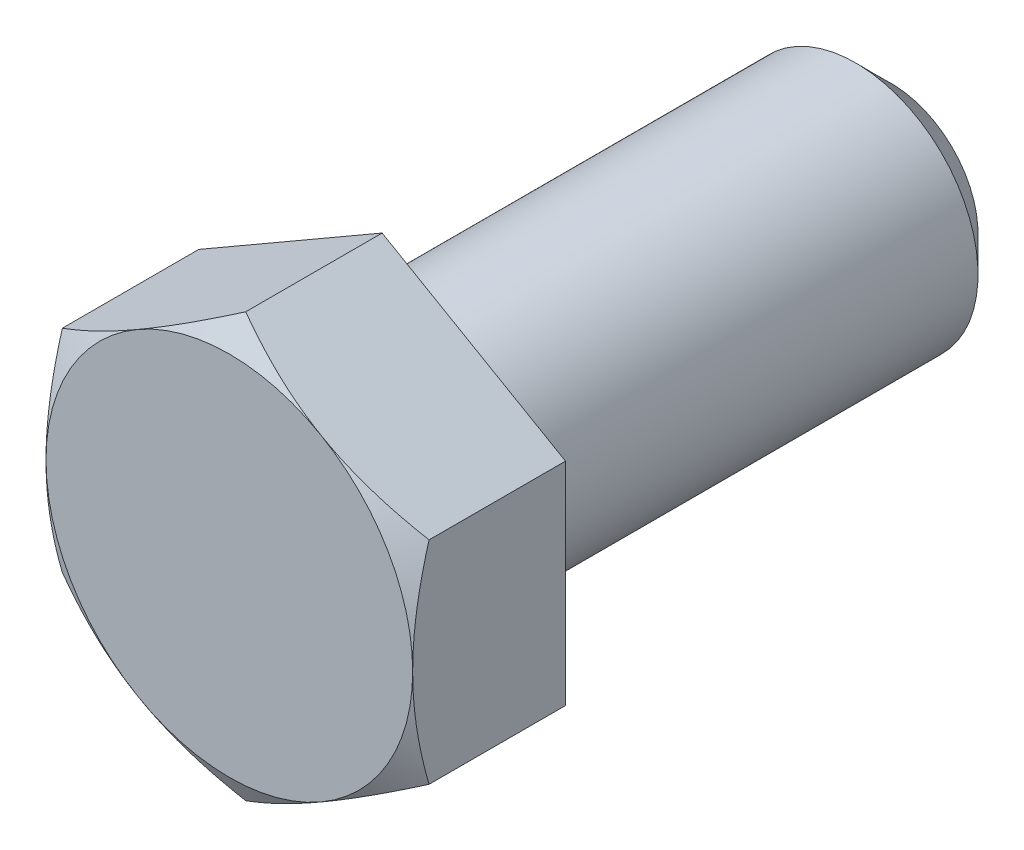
ISO-10303-21;
HEADER;
FILE_DESCRIPTION(('STEP AP214'),'2;1');
FILE_NAME('part.step','',(''),(''),'','','');
FILE_SCHEMA(('AUTOMOTIVE_DESIGN { 1 0 10303 214 1 1 1 1 }'));
ENDSEC;
DATA;
#1=APPLICATION_CONTEXT('core data for automotive mechanical design processes');
#2=APPLICATION_PROTOCOL_DEFINITION('international standard','automotive_design',2000,#1);
#3=PRODUCT_CONTEXT('',#1,'mechanical');
#4=PRODUCT('Part','Part','',(#3));
#5=PRODUCT_RELATED_PRODUCT_CATEGORY('part','',(#4));
#6=PRODUCT_DEFINITION_FORMATION('','',#4);
#7=PRODUCT_DEFINITION_CONTEXT('part definition',#1,'design');
#8=PRODUCT_DEFINITION('design','',#6,#7);
#9=PRODUCT_DEFINITION_SHAPE('','',#8);
#10=(LENGTH_UNIT() NAMED_UNIT(*) SI_UNIT(.MILLI.,.METRE.));
#11=(NAMED_UNIT(*) PLANE_ANGLE_UNIT() SI_UNIT($,.RADIAN.));
#12=(NAMED_UNIT(*) SI_UNIT($,.STERADIAN.) SOLID_ANGLE_UNIT());
#13=UNCERTAINTY_MEASURE_WITH_UNIT(LENGTH_MEASURE(1.E-05),#10,'distance_accuracy_value','');
#14=(GEOMETRIC_REPRESENTATION_CONTEXT(3) GLOBAL_UNCERTAINTY_ASSIGNED_CONTEXT((#13)) GLOBAL_UNIT_ASSIGNED_CONTEXT((#10,
#11,#12)) REPRESENTATION_CONTEXT('',''));
#15=CARTESIAN_POINT('',(0.,0.,0.));
#16=DIRECTION('',(0.,0.,1.));
#17=DIRECTION('',(1.,0.,0.));
#18=AXIS2_PLACEMENT_3D('',#15,#16,#17);
#19=CARTESIAN_POINT('',(-17.9999999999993,0.,0.));
#20=DIRECTION('',(0.,0.,1.));
#21=DIRECTION('',(1.,0.,0.));
#22=AXIS2_PLACEMENT_3D('',#19,#20,#21);
#23=PLANE('',#22);
#24=DIRECTION('',(-0.866025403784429,-0.500000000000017,0.));
#25=VECTOR('',#24,1.);
#26=CARTESIAN_POINT('',(-8.9999999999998,5.19615242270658,0.));
#27=LINE('',#26,#25);
#28=CARTESIAN_POINT('',(0.,10.3923048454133,0.));
#29=VERTEX_POINT('',#28);
#30=CARTESIAN_POINT('',(-8.9999999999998,5.19615242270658,0.));
#31=VERTEX_POINT('',#30);
#32=EDGE_CURVE('E136',#29,#31,#27,.T.);
#33=ORIENTED_EDGE('',*,*,#32,.F.);
#34=DIRECTION('',(-0.866025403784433,0.50000000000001,0.));
#35=VECTOR('',#34,1.);
#36=CARTESIAN_POINT('',(0.,10.3923048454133,0.));
#37=LINE('',#36,#35);
#38=CARTESIAN_POINT('',(9.,5.19615242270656,0.));
#39=VERTEX_POINT('',#38);
#40=EDGE_CURVE('E113',#39,#29,#37,.T.);
#41=ORIENTED_EDGE('',*,*,#40,.F.);
#42=DIRECTION('',(0.,1.,0.));
#43=VECTOR('',#42,1.);
#44=CARTESIAN_POINT('',(9.,5.19615242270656,0.));
#45=LINE('',#44,#43);
#46=CARTESIAN_POINT('',(9.,-5.19615242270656,0.));
#47=VERTEX_POINT('',#46);
#48=EDGE_CURVE('E106',#47,#39,#45,.T.);
#49=ORIENTED_EDGE('',*,*,#48,.F.);
#50=DIRECTION('',(0.866025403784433,0.50000000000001,0.));
#51=VECTOR('',#50,1.);
#52=CARTESIAN_POINT('',(9.,-5.19615242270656,0.));
#53=LINE('',#52,#51);
#54=CARTESIAN_POINT('',(0.,-10.3923048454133,0.));
#55=VERTEX_POINT('',#54);
#56=EDGE_CURVE('E441',#55,#47,#53,.T.);
#57=ORIENTED_EDGE('',*,*,#56,.F.);
#58=DIRECTION('',(0.866025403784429,-0.500000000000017,0.));
#59=VECTOR('',#58,1.);
#60=CARTESIAN_POINT('',(-8.9999999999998,-5.19615242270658,0.));
#61=LINE('',#60,#59);
#62=CARTESIAN_POINT('',(-8.9999999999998,-5.19615242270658,0.));
#63=VERTEX_POINT('',#62);
#64=EDGE_CURVE('E446',#63,#55,#61,.T.);
#65=ORIENTED_EDGE('',*,*,#64,.F.);
#66=DIRECTION('',(0.,-1.,0.));
#67=VECTOR('',#66,1.);
#68=CARTESIAN_POINT('',(-8.9999999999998,5.19615242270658,0.));
#69=LINE('',#68,#67);
#70=EDGE_CURVE('E157',#31,#63,#69,.T.);
#71=ORIENTED_EDGE('',*,*,#70,.F.);
#72=EDGE_LOOP('',(#33,#41,#49,#57,#65,#71));
#73=FACE_BOUND('',#72,.T.);
#74=CARTESIAN_POINT('',(0.,0.,0.));
#75=DIRECTION('',(0.,0.,-1.));
#76=DIRECTION('',(-1.,0.,0.));
#77=AXIS2_PLACEMENT_3D('',#74,#75,#76);
#78=CIRCLE('',#77,6.);
#79=CARTESIAN_POINT('',(-6.,0.,0.));
#80=VERTEX_POINT('',#79);
#81=EDGE_CURVE('E427',#80,#80,#78,.T.);
#82=ORIENTED_EDGE('',*,*,#81,.F.);
#83=EDGE_LOOP('',(#82));
#84=FACE_BOUND('',#83,.T.);
#85=ADVANCED_FACE('F16',(#73,#84),#23,.F.);
#86=CARTESIAN_POINT('',(-8.9999999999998,5.19615242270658,7.5));
#87=DIRECTION('',(0.500000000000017,-0.866025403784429,0.));
#88=DIRECTION('',(0.866025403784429,0.500000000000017,0.));
#89=AXIS2_PLACEMENT_3D('',#86,#87,#88);
#90=PLANE('',#89);
#91=CARTESIAN_POINT('',(0.000200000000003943,10.3924203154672,6.69608575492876));
#92=CARTESIAN_POINT('',(-0.197607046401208,10.2782163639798,6.76201799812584));
#93=CARTESIAN_POINT('',(-0.396185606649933,10.1635669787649,6.82495859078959));
#94=CARTESIAN_POINT('',(-0.794955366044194,9.93333715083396,6.94403100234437));
#95=CARTESIAN_POINT('',(-0.995147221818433,9.81775632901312,7.00015988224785));
#96=CARTESIAN_POINT('',(-1.39751505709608,9.58544915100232,7.10484803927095));
#97=CARTESIAN_POINT('',(-1.59969459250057,9.46872074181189,7.15338922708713));
#98=CARTESIAN_POINT('',(-2.00542875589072,9.23447001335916,7.241851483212));
#99=CARTESIAN_POINT('',(-2.20898309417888,9.11694786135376,7.28177431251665));
#100=CARTESIAN_POINT('',(-2.61230590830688,8.88408932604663,7.35131532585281));
#101=CARTESIAN_POINT('',(-2.81204459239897,8.76877014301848,7.38116249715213));
#102=CARTESIAN_POINT('',(-3.21241567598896,8.53761579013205,7.43120669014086));
#103=CARTESIAN_POINT('',(-3.41304799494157,8.42178066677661,7.4514045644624));
#104=CARTESIAN_POINT('',(-3.81466063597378,8.1899095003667,7.4816456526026));
#105=CARTESIAN_POINT('',(-4.0156403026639,8.07387383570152,7.49170039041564));
#106=CARTESIAN_POINT('',(-4.41778459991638,7.84169571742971,7.50143766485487));
#107=CARTESIAN_POINT('',(-4.61894922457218,7.72555326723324,7.50112052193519));
#108=CARTESIAN_POINT('',(-4.99503261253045,7.50842142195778,7.49083604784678));
#109=CARTESIAN_POINT('',(-5.16997789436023,7.4074167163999,7.48212325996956));
#110=CARTESIAN_POINT('',(-5.51945867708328,7.20564389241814,7.4570226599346));
#111=CARTESIAN_POINT('',(-5.69399414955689,7.10487579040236,7.4406343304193));
#112=CARTESIAN_POINT('',(-6.21692487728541,6.80296159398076,7.38034344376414));
#113=CARTESIAN_POINT('',(-6.56439451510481,6.6023499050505,7.32532251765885));
#114=CARTESIAN_POINT('',(-7.26301962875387,6.19899850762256,7.18776952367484));
#115=CARTESIAN_POINT('',(-7.61408594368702,5.99631027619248,7.10465438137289));
#116=CARTESIAN_POINT('',(-8.31098330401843,5.59395639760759,6.91601746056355));
#117=CARTESIAN_POINT('',(-8.65682327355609,5.39428559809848,6.81053998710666));
#118=CARTESIAN_POINT('',(-9.0001999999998,5.19603695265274,6.69608575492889));
#119=B_SPLINE_CURVE_WITH_KNOTS('',3,(#91,#92,#93,#94,#95,#96,#97,#98,#99,#100,#101,#102,#103,
#104,#105,#106,#107,#108,#109,#110,#111,#112,#113,#114,#115,#116,#117,#118),.UNSPECIFIED.,.F.,
.F.,(4,2,2,2,2,2,2,2,2,2,2,2,2,4),(0.,0.713219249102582,1.4267451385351,2.14194697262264,
2.85700253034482,3.55449749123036,4.25193080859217,4.94857085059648,5.64518936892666,
6.25162976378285,6.8581110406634,8.0719374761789,9.31268391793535,10.5509947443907),.UNSPECIFIED.);
#120=CARTESIAN_POINT('',(0.,10.3923048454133,6.69615242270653));
#121=VERTEX_POINT('',#120);
#122=CARTESIAN_POINT('',(-4.5,7.79422863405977,7.5));
#123=VERTEX_POINT('',#122);
#124=EDGE_CURVE('E133',#121,#123,#119,.T.);
#125=ORIENTED_EDGE('',*,*,#124,.F.);
#126=DIRECTION('',(0.,0.,-1.));
#127=VECTOR('',#126,1.);
#128=CARTESIAN_POINT('',(0.,10.3923048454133,7.5));
#129=LINE('',#128,#127);
#130=EDGE_CURVE('E109',#121,#29,#129,.T.);
#131=ORIENTED_EDGE('',*,*,#130,.T.);
#132=ORIENTED_EDGE('',*,*,#32,.T.);
#133=DIRECTION('',(0.,0.,-1.));
#134=VECTOR('',#133,1.);
#135=CARTESIAN_POINT('',(-8.9999999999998,5.19615242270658,7.5));
#136=LINE('',#135,#134);
#137=CARTESIAN_POINT('',(-8.9999999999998,5.19615242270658,6.69615242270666));
#138=VERTEX_POINT('',#137);
#139=EDGE_CURVE('E119',#138,#31,#136,.T.);
#140=ORIENTED_EDGE('',*,*,#139,.F.);
#141=EDGE_CURVE('E137',#123,#138,#119,.T.);
#142=ORIENTED_EDGE('',*,*,#141,.F.);
#143=EDGE_LOOP('',(#125,#131,#132,#140,#142));
#144=FACE_BOUND('',#143,.T.);
#145=ADVANCED_FACE('F139',(#144),#90,.F.);
#146=CARTESIAN_POINT('',(-8.9999999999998,5.19615242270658,7.5));
#147=DIRECTION('',(1.,0.,0.));
#148=DIRECTION('',(0.,0.,-1.));
#149=AXIS2_PLACEMENT_3D('',#146,#147,#148);
#150=PLANE('',#149);
#151=CARTESIAN_POINT('',(-8.9999999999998,-14.193805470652,2.99281770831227));
#152=CARTESIAN_POINT('',(-8.9999999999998,-13.7986249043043,3.18545400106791));
#153=CARTESIAN_POINT('',(-8.9999999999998,-13.4025620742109,3.37631016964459));
#154=CARTESIAN_POINT('',(-8.9999999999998,-12.6082034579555,3.75346543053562));
#155=CARTESIAN_POINT('',(-8.9999999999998,-12.2099073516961,3.93976384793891));
#156=CARTESIAN_POINT('',(-8.9999999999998,-11.4086732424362,4.30769386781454));
#157=CARTESIAN_POINT('',(-8.9999999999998,-11.0057218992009,4.4892965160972));
#158=CARTESIAN_POINT('',(-8.9999999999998,-10.1966954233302,4.84537774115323));
#159=CARTESIAN_POINT('',(-8.9999999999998,-9.7906204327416,5.01985663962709));
#160=CARTESIAN_POINT('',(-8.9999999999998,-8.96081603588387,5.36560228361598));
#161=CARTESIAN_POINT('',(-8.9999999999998,-8.53695616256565,5.53655757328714));
#162=CARTESIAN_POINT('',(-8.9999999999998,-7.68436682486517,5.86609252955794));
#163=CARTESIAN_POINT('',(-8.9999999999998,-7.25563683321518,6.02467084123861));
#164=CARTESIAN_POINT('',(-8.9999999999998,-6.39334839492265,6.32546141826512));
#165=CARTESIAN_POINT('',(-8.9999999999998,-5.95980093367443,6.46770484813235));
#166=CARTESIAN_POINT('',(-8.9999999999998,-5.08650675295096,6.7314200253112));
#167=CARTESIAN_POINT('',(-8.9999999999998,-4.6467619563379,6.85289806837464));
#168=CARTESIAN_POINT('',(-8.9999999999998,-3.76318857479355,7.06875933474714));
#169=CARTESIAN_POINT('',(-8.9999999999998,-3.31939822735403,7.16329494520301));
#170=CARTESIAN_POINT('',(-8.9999999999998,-2.64948950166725,7.28091249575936));
#171=CARTESIAN_POINT('',(-8.9999999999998,-2.42546830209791,7.31608884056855));
#172=CARTESIAN_POINT('',(-8.9999999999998,-1.97623392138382,7.37769613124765));
#173=CARTESIAN_POINT('',(-8.9999999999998,-1.75102085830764,7.40412792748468));
#174=CARTESIAN_POINT('',(-8.9999999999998,-1.3027498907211,7.44737513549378));
#175=CARTESIAN_POINT('',(-8.9999999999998,-1.07970414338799,7.46431601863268));
#176=CARTESIAN_POINT('',(-8.9999999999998,-0.633095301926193,7.48874105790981));
#177=CARTESIAN_POINT('',(-8.9999999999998,-0.409532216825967,7.49622537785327));
#178=CARTESIAN_POINT('',(-8.9999999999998,0.0377121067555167,7.5015576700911));
#179=CARTESIAN_POINT('',(-8.9999999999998,0.261393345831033,7.49940559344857));
#180=CARTESIAN_POINT('',(-8.9999999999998,0.708460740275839,7.48552018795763));
#181=CARTESIAN_POINT('',(-8.9999999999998,0.931846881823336,7.47378642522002));
#182=CARTESIAN_POINT('',(-8.9999999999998,1.46162752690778,7.4348503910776));
#183=CARTESIAN_POINT('',(-8.9999999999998,1.7677239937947,7.40349650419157));
#184=CARTESIAN_POINT('',(-8.9999999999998,2.37778404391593,7.32445593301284));
#185=CARTESIAN_POINT('',(-8.9999999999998,2.68174735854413,7.2767672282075));
#186=CARTESIAN_POINT('',(-8.9999999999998,3.59000335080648,7.11171638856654));
#187=CARTESIAN_POINT('',(-8.9999999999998,4.19036603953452,6.97239428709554));
#188=CARTESIAN_POINT('',(-8.9999999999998,5.088581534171,6.72898039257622));
#189=CARTESIAN_POINT('',(-8.9999999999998,5.3910401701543,6.64089135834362));
#190=CARTESIAN_POINT('',(-8.9999999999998,5.9930241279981,6.45511431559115));
#191=CARTESIAN_POINT('',(-8.9999999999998,6.29254942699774,6.35742623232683));
#192=CARTESIAN_POINT('',(-8.9999999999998,6.88875586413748,6.15405553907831));
#193=CARTESIAN_POINT('',(-8.9999999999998,7.18543776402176,6.04837514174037));
#194=CARTESIAN_POINT('',(-8.9999999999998,7.77631041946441,5.83030807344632));
#195=CARTESIAN_POINT('',(-8.9999999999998,8.07050123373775,5.7179215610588));
#196=CARTESIAN_POINT('',(-8.9999999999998,8.86768097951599,5.40462740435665));
#197=CARTESIAN_POINT('',(-8.9999999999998,9.36851420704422,5.19823951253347));
#198=CARTESIAN_POINT('',(-8.9999999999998,10.3649647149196,4.77318997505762));
#199=CARTESIAN_POINT('',(-8.9999999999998,10.8605813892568,4.55452692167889));
#200=CARTESIAN_POINT('',(-8.9999999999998,11.8478077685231,4.10785524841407));
#201=CARTESIAN_POINT('',(-8.9999999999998,12.3394158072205,3.87984295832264));
#202=CARTESIAN_POINT('',(-8.9999999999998,13.3192435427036,3.41672758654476));
#203=CARTESIAN_POINT('',(-8.9999999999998,13.8074633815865,3.18162480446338));
#204=CARTESIAN_POINT('',(-8.9999999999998,14.7819931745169,2.70549247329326));
#205=CARTESIAN_POINT('',(-8.9999999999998,15.2682986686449,2.46445381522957));
#206=CARTESIAN_POINT('',(-8.9999999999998,16.238706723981,1.97797920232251));
#207=CARTESIAN_POINT('',(-8.9999999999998,16.7228092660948,1.7325432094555));
#208=CARTESIAN_POINT('',(-8.9999999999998,17.6890969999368,1.2381998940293));
#209=CARTESIAN_POINT('',(-8.9999999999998,18.1712826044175,0.989293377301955));
#210=CARTESIAN_POINT('',(-8.9999999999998,19.1341609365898,0.488607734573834));
#211=CARTESIAN_POINT('',(-8.9999999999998,19.6148536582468,0.236828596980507));
#212=CARTESIAN_POINT('',(-8.9999999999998,20.9522159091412,-0.467839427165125));
#213=CARTESIAN_POINT('',(-8.9999999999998,21.8075292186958,-0.923301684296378));
#214=CARTESIAN_POINT('',(-8.9999999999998,23.5152984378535,-1.83966951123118));
#215=CARTESIAN_POINT('',(-8.9999999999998,24.367754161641,-2.30057542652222));
#216=CARTESIAN_POINT('',(-8.9999999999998,26.0675482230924,-3.22485857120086));
#217=CARTESIAN_POINT('',(-8.9999999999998,26.9148940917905,-3.68822195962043));
#218=CARTESIAN_POINT('',(-8.9999999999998,28.1846057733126,-4.38556367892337));
#219=CARTESIAN_POINT('',(-8.9999999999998,28.6076082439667,-4.61838432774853));
#220=CARTESIAN_POINT('',(-8.9999999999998,29.4532343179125,-5.08471147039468));
#221=CARTESIAN_POINT('',(-8.9999999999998,29.8758579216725,-5.3182179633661));
#222=CARTESIAN_POINT('',(-8.9999999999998,30.2983153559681,-5.55202477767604));
#223=B_SPLINE_CURVE_WITH_KNOTS('',3,(#151,#152,#153,#154,#155,#156,#157,#158,#159,#160,#161,
#162,#163,#164,#165,#166,#167,#168,#169,#170,#171,#172,#173,#174,#175,#176,#177,#178,#179,#180,
#181,#182,#183,#184,#185,#186,#187,#188,#189,#190,#191,#192,#193,#194,#195,#196,#197,#198,#199,
#200,#201,#202,#203,#204,#205,#206,#207,#208,#209,#210,#211,#212,#213,#214,#215,#216,#217,#218,
#219,#220,#221,#222),.UNSPECIFIED.,.F.,.F.,(4,2,2,2,2,2,2,2,2,2,2,2,2,2,2,2,2,2,2,2,2,2,2,2,2,2,
2,2,2,2,2,2,2,2,2,4),(0.,1.31891143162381,2.63801699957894,3.96391175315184,5.28974656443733,
6.66070766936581,8.03181864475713,9.40026868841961,10.7683030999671,12.1284389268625,
12.8085936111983,13.4886821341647,14.1595537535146,14.8304137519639,15.5012771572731,
16.1721709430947,17.0947490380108,18.0174412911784,19.8637129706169,20.8087031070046,
21.7537006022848,22.6984374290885,23.6431519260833,25.2679809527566,26.8929966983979,
28.5186565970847,30.1442479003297,31.7725119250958,33.4007900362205,35.0286961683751,
36.6566088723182,39.5636489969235,42.4708746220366,45.3681585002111,46.8166845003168,
48.2652087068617),.UNSPECIFIED.);
#224=CARTESIAN_POINT('',(-8.99999999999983,0.,7.5));
#225=VERTEX_POINT('',#224);
#226=EDGE_CURVE('E143',#138,#225,#223,.F.);
#227=ORIENTED_EDGE('',*,*,#226,.F.);
#228=ORIENTED_EDGE('',*,*,#139,.T.);
#229=ORIENTED_EDGE('',*,*,#70,.T.);
#230=DIRECTION('',(0.,0.,-1.));
#231=VECTOR('',#230,1.);
#232=CARTESIAN_POINT('',(-8.9999999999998,-5.19615242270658,7.5));
#233=LINE('',#232,#231);
#234=CARTESIAN_POINT('',(-8.9999999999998,-5.19615242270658,6.69615242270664));
#235=VERTEX_POINT('',#234);
#236=EDGE_CURVE('E118',#235,#63,#233,.T.);
#237=ORIENTED_EDGE('',*,*,#236,.F.);
#238=EDGE_CURVE('E144',#225,#235,#223,.F.);
#239=ORIENTED_EDGE('',*,*,#238,.F.);
#240=EDGE_LOOP('',(#227,#228,#229,#237,#239));
#241=FACE_BOUND('',#240,.T.);
#242=ADVANCED_FACE('F206',(#241),#150,.F.);
#243=CARTESIAN_POINT('',(-8.9999999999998,-5.19615242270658,7.5));
#244=DIRECTION('',(0.500000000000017,0.866025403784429,0.));
#245=DIRECTION('',(-0.866025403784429,0.500000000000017,0.));
#246=AXIS2_PLACEMENT_3D('',#243,#244,#245);
#247=PLANE('',#246);
#248=CARTESIAN_POINT('',(-9.0001999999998,-5.19603695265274,6.69608575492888));
#249=CARTESIAN_POINT('',(-8.80239295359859,-5.31024090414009,6.76201799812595));
#250=CARTESIAN_POINT('',(-8.60381439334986,-5.42489028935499,6.82495859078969));
#251=CARTESIAN_POINT('',(-8.20504463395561,-5.65512011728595,6.94403100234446));
#252=CARTESIAN_POINT('',(-8.00485277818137,-5.77070093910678,7.00015988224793));
#253=CARTESIAN_POINT('',(-7.60248494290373,-6.00300811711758,7.10484803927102));
#254=CARTESIAN_POINT('',(-7.40030540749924,-6.11973652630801,7.1533892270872));
#255=CARTESIAN_POINT('',(-6.9945712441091,-6.35398725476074,7.24185148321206));
#256=CARTESIAN_POINT('',(-6.79101690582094,-6.47150940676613,7.2817743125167));
#257=CARTESIAN_POINT('',(-6.38769409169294,-6.70436794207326,7.35131532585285));
#258=CARTESIAN_POINT('',(-6.18795540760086,-6.81968712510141,7.38116249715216));
#259=CARTESIAN_POINT('',(-5.78758432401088,-7.05084147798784,7.43120669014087));
#260=CARTESIAN_POINT('',(-5.58695200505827,-7.16667660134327,7.45140456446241));
#261=CARTESIAN_POINT('',(-5.18533936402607,-7.39854776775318,7.48164565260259));
#262=CARTESIAN_POINT('',(-4.98435969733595,-7.51458343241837,7.49170039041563));
#263=CARTESIAN_POINT('',(-4.58221540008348,-7.74676155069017,7.50143766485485));
#264=CARTESIAN_POINT('',(-4.38105077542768,-7.86290400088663,7.50112052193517));
#265=CARTESIAN_POINT('',(-4.00496738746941,-8.08003584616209,7.49083604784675));
#266=CARTESIAN_POINT('',(-3.83002210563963,-8.18104055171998,7.48212325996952));
#267=CARTESIAN_POINT('',(-3.48054132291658,-8.38281337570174,7.45702265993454));
#268=CARTESIAN_POINT('',(-3.30600585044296,-8.48358147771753,7.44063433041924));
#269=CARTESIAN_POINT('',(-2.78307512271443,-8.78549567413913,7.38034344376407));
#270=CARTESIAN_POINT('',(-2.43560548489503,-8.9861073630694,7.32532251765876));
#271=CARTESIAN_POINT('',(-1.73698037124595,-9.38945876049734,7.18776952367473));
#272=CARTESIAN_POINT('',(-1.38591405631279,-9.59214699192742,7.10465438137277));
#273=CARTESIAN_POINT('',(-0.689016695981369,-9.99450087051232,6.91601746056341));
#274=CARTESIAN_POINT('',(-0.343176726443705,-10.1941716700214,6.81053998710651));
#275=CARTESIAN_POINT('',(0.00020000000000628,-10.3924203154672,6.69608575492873));
#276=B_SPLINE_CURVE_WITH_KNOTS('',3,(#248,#249,#250,#251,#252,#253,#254,#255,#256,#257,#258,
#259,#260,#261,#262,#263,#264,#265,#266,#267,#268,#269,#270,#271,#272,#273,#274,#275),
.UNSPECIFIED.,.F.,.F.,(4,2,2,2,2,2,2,2,2,2,2,2,2,4),(0.,0.713219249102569,1.42674513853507,
2.1419469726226,2.85700253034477,3.55449749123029,4.25193080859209,4.94857085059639,
5.64518936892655,6.25162976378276,6.85811104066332,8.07193747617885,9.31268391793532,
10.5509947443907),.UNSPECIFIED.);
#277=CARTESIAN_POINT('',(-4.5,-7.79422863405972,7.5));
#278=VERTEX_POINT('',#277);
#279=EDGE_CURVE('E191',#235,#278,#276,.T.);
#280=ORIENTED_EDGE('',*,*,#279,.F.);
#281=ORIENTED_EDGE('',*,*,#236,.T.);
#282=ORIENTED_EDGE('',*,*,#64,.T.);
#283=DIRECTION('',(0.,0.,-1.));
#284=VECTOR('',#283,1.);
#285=CARTESIAN_POINT('',(0.,-10.3923048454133,7.5));
#286=LINE('',#285,#284);
#287=CARTESIAN_POINT('',(0.,-10.3923048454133,6.6961524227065));
#288=VERTEX_POINT('',#287);
#289=EDGE_CURVE('E111',#288,#55,#286,.T.);
#290=ORIENTED_EDGE('',*,*,#289,.F.);
#291=EDGE_CURVE('E186',#278,#288,#276,.T.);
#292=ORIENTED_EDGE('',*,*,#291,.F.);
#293=EDGE_LOOP('',(#280,#281,#282,#290,#292));
#294=FACE_BOUND('',#293,.T.);
#295=ADVANCED_FACE('F209',(#294),#247,.F.);
#296=CARTESIAN_POINT('',(9.,-5.19615242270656,7.5));
#297=DIRECTION('',(-0.50000000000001,0.866025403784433,0.));
#298=DIRECTION('',(-0.866025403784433,-0.50000000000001,0.));
#299=AXIS2_PLACEMENT_3D('',#296,#297,#298);
#300=PLANE('',#299);
#301=CARTESIAN_POINT('',(-0.000199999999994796,-10.3924203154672,6.69608575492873));
#302=CARTESIAN_POINT('',(0.197607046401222,-10.2782163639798,6.76201799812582));
#303=CARTESIAN_POINT('',(0.39618560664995,-10.1635669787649,6.82495859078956));
#304=CARTESIAN_POINT('',(0.794955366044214,-9.93333715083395,6.94403100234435));
#305=CARTESIAN_POINT('',(0.995147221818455,-9.81775632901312,7.00015988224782));
#306=CARTESIAN_POINT('',(1.3975150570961,-9.58544915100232,7.10484803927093));
#307=CARTESIAN_POINT('',(1.5996945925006,-9.46872074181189,7.15338922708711));
#308=CARTESIAN_POINT('',(2.00542875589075,-9.23447001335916,7.24185148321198));
#309=CARTESIAN_POINT('',(2.20898309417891,-9.11694786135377,7.28177431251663));
#310=CARTESIAN_POINT('',(2.61230590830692,-8.88408932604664,7.35131532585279));
#311=CARTESIAN_POINT('',(2.81204459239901,-8.76877014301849,7.38116249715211));
#312=CARTESIAN_POINT('',(3.212415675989,-8.53761579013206,7.43120669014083));
#313=CARTESIAN_POINT('',(3.41304799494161,-8.42178066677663,7.45140456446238));
#314=CARTESIAN_POINT('',(3.81466063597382,-8.18990950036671,7.48164565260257));
#315=CARTESIAN_POINT('',(4.01564030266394,-8.07387383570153,7.49170039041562));
#316=CARTESIAN_POINT('',(4.41778459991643,-7.84169571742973,7.50143766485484));
#317=CARTESIAN_POINT('',(4.61894922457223,-7.72555326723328,7.50112052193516));
#318=CARTESIAN_POINT('',(4.99503261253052,-7.50842142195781,7.49083604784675));
#319=CARTESIAN_POINT('',(5.1699778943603,-7.40741671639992,7.48212325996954));
#320=CARTESIAN_POINT('',(5.51945867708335,-7.20564389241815,7.45702265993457));
#321=CARTESIAN_POINT('',(5.69399414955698,-7.10487579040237,7.44063433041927));
#322=CARTESIAN_POINT('',(6.21692487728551,-6.80296159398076,7.38034344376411));
#323=CARTESIAN_POINT('',(6.56439451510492,-6.6023499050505,7.32532251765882));
#324=CARTESIAN_POINT('',(7.263019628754,-6.19899850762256,7.1877695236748));
#325=CARTESIAN_POINT('',(7.61408594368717,-5.99631027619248,7.10465438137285));
#326=CARTESIAN_POINT('',(8.31098330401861,-5.59395639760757,6.91601746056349));
#327=CARTESIAN_POINT('',(8.65682327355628,-5.39428559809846,6.8105399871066));
#328=CARTESIAN_POINT('',(9.0002,-5.19603695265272,6.69608575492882));
#329=B_SPLINE_CURVE_WITH_KNOTS('',3,(#301,#302,#303,#304,#305,#306,#307,#308,#309,#310,#311,
#312,#313,#314,#315,#316,#317,#318,#319,#320,#321,#322,#323,#324,#325,#326,#327,#328),
.UNSPECIFIED.,.F.,.F.,(4,2,2,2,2,2,2,2,2,2,2,2,2,4),(0.,0.713219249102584,1.4267451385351,
2.14194697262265,2.85700253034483,3.55449749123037,4.25193080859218,4.9485708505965,
5.64518936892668,6.25162976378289,6.85811104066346,8.071937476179,9.31268391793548,
10.5509947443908),.UNSPECIFIED.);
#330=CARTESIAN_POINT('',(4.50000000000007,-7.79422863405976,7.5));
#331=VERTEX_POINT('',#330);
#332=EDGE_CURVE('E192',#288,#331,#329,.T.);
#333=ORIENTED_EDGE('',*,*,#332,.F.);
#334=ORIENTED_EDGE('',*,*,#289,.T.);
#335=ORIENTED_EDGE('',*,*,#56,.T.);
#336=DIRECTION('',(0.,0.,-1.));
#337=VECTOR('',#336,1.);
#338=CARTESIAN_POINT('',(9.,-5.19615242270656,7.5));
#339=LINE('',#338,#337);
#340=CARTESIAN_POINT('',(9.,-5.19615242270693,6.69615242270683));
#341=VERTEX_POINT('',#340);
#342=EDGE_CURVE('E108',#341,#47,#339,.T.);
#343=ORIENTED_EDGE('',*,*,#342,.F.);
#344=EDGE_CURVE('E181',#331,#341,#329,.T.);
#345=ORIENTED_EDGE('',*,*,#344,.F.);
#346=EDGE_LOOP('',(#333,#334,#335,#343,#345));
#347=FACE_BOUND('',#346,.T.);
#348=ADVANCED_FACE('F212',(#347),#300,.F.);
#349=CARTESIAN_POINT('',(9.,5.19615242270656,7.5));
#350=DIRECTION('',(-1.,0.,0.));
#351=DIRECTION('',(0.,0.,1.));
#352=AXIS2_PLACEMENT_3D('',#349,#350,#351);
#353=PLANE('',#352);
#354=CARTESIAN_POINT('',(9.,-14.193805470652,2.99281770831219));
#355=CARTESIAN_POINT('',(9.,-13.7986249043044,3.18545400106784));
#356=CARTESIAN_POINT('',(9.,-13.402562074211,3.37631016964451));
#357=CARTESIAN_POINT('',(9.,-12.6082034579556,3.75346543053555));
#358=CARTESIAN_POINT('',(9.,-12.2099073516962,3.93976384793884));
#359=CARTESIAN_POINT('',(9.,-11.4086732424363,4.30769386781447));
#360=CARTESIAN_POINT('',(9.,-11.0057218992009,4.48929651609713));
#361=CARTESIAN_POINT('',(9.,-10.1966954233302,4.84537774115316));
#362=CARTESIAN_POINT('',(9.,-9.79062043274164,5.01985663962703));
#363=CARTESIAN_POINT('',(9.,-8.96081603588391,5.36560228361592));
#364=CARTESIAN_POINT('',(9.,-8.53695616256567,5.53655757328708));
#365=CARTESIAN_POINT('',(9.,-7.68436682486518,5.86609252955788));
#366=CARTESIAN_POINT('',(9.,-7.25563683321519,6.02467084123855));
#367=CARTESIAN_POINT('',(9.,-6.39334839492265,6.32546141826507));
#368=CARTESIAN_POINT('',(9.,-5.95980093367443,6.4677048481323));
#369=CARTESIAN_POINT('',(9.,-5.08650675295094,6.73142002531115));
#370=CARTESIAN_POINT('',(9.,-4.64676195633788,6.85289806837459));
#371=CARTESIAN_POINT('',(9.,-3.76318857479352,7.06875933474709));
#372=CARTESIAN_POINT('',(9.,-3.31939822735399,7.16329494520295));
#373=CARTESIAN_POINT('',(9.,-2.64948950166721,7.2809124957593));
#374=CARTESIAN_POINT('',(9.,-2.42546830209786,7.31608884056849));
#375=CARTESIAN_POINT('',(9.,-1.97623392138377,7.37769613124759));
#376=CARTESIAN_POINT('',(9.,-1.75102085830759,7.40412792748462));
#377=CARTESIAN_POINT('',(9.,-1.30274989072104,7.44737513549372));
#378=CARTESIAN_POINT('',(9.,-1.07970414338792,7.46431601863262));
#379=CARTESIAN_POINT('',(9.,-0.633095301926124,7.48874105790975));
#380=CARTESIAN_POINT('',(9.,-0.409532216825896,7.4962253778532));
#381=CARTESIAN_POINT('',(9.,0.0377121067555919,7.50155767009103));
#382=CARTESIAN_POINT('',(9.,0.26139334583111,7.4994055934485));
#383=CARTESIAN_POINT('',(9.,0.708460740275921,7.48552018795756));
#384=CARTESIAN_POINT('',(9.,0.93184688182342,7.47378642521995));
#385=CARTESIAN_POINT('',(9.,1.46162752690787,7.43485039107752));
#386=CARTESIAN_POINT('',(9.,1.7677239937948,7.40349650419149));
#387=CARTESIAN_POINT('',(9.,2.37778404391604,7.32445593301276));
#388=CARTESIAN_POINT('',(9.,2.68174735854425,7.27676722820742));
#389=CARTESIAN_POINT('',(9.,3.59000335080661,7.11171638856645));
#390=CARTESIAN_POINT('',(9.,4.19036603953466,6.97239428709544));
#391=CARTESIAN_POINT('',(9.,5.08858153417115,6.72898039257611));
#392=CARTESIAN_POINT('',(9.,5.39104017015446,6.64089135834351));
#393=CARTESIAN_POINT('',(9.,5.99302412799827,6.45511431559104));
#394=CARTESIAN_POINT('',(9.,6.29254942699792,6.35742623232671));
#395=CARTESIAN_POINT('',(9.,6.88875586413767,6.15405553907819));
#396=CARTESIAN_POINT('',(9.,7.18543776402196,6.04837514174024));
#397=CARTESIAN_POINT('',(9.,7.77631041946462,5.83030807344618));
#398=CARTESIAN_POINT('',(9.,8.07050123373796,5.71792156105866));
#399=CARTESIAN_POINT('',(9.,8.86768097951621,5.40462740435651));
#400=CARTESIAN_POINT('',(9.,9.36851420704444,5.19823951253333));
#401=CARTESIAN_POINT('',(9.,10.3649647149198,4.77318997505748));
#402=CARTESIAN_POINT('',(9.,10.860581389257,4.55452692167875));
#403=CARTESIAN_POINT('',(9.,11.8478077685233,4.10785524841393));
#404=CARTESIAN_POINT('',(9.,12.3394158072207,3.8798429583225));
#405=CARTESIAN_POINT('',(9.,13.3192435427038,3.41672758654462));
#406=CARTESIAN_POINT('',(9.,13.8074633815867,3.18162480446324));
#407=CARTESIAN_POINT('',(9.,14.7819931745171,2.70549247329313));
#408=CARTESIAN_POINT('',(9.,15.2682986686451,2.46445381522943));
#409=CARTESIAN_POINT('',(9.,16.2387067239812,1.97797920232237));
#410=CARTESIAN_POINT('',(9.,16.722809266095,1.73254320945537));
#411=CARTESIAN_POINT('',(9.,17.689096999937,1.23819989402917));
#412=CARTESIAN_POINT('',(9.,18.1712826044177,0.989293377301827));
#413=CARTESIAN_POINT('',(9.,19.13416093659,0.488607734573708));
#414=CARTESIAN_POINT('',(9.,19.614853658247,0.236828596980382));
#415=CARTESIAN_POINT('',(9.,20.9522159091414,-0.467839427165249));
#416=CARTESIAN_POINT('',(9.,21.807529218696,-0.923301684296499));
#417=CARTESIAN_POINT('',(9.,23.5152984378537,-1.8396695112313));
#418=CARTESIAN_POINT('',(9.,24.3677541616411,-2.30057542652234));
#419=CARTESIAN_POINT('',(9.,26.0675482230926,-3.22485857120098));
#420=CARTESIAN_POINT('',(9.,26.9148940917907,-3.68822195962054));
#421=CARTESIAN_POINT('',(9.,28.1846057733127,-4.38556367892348));
#422=CARTESIAN_POINT('',(9.,28.6076082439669,-4.61838432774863));
#423=CARTESIAN_POINT('',(9.,29.4532343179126,-5.08471147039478));
#424=CARTESIAN_POINT('',(9.,29.8758579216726,-5.31821796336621));
#425=CARTESIAN_POINT('',(9.,30.2983153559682,-5.55202477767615));
#426=B_SPLINE_CURVE_WITH_KNOTS('',3,(#354,#355,#356,#357,#358,#359,#360,#361,#362,#363,#364,
#365,#366,#367,#368,#369,#370,#371,#372,#373,#374,#375,#376,#377,#378,#379,#380,#381,#382,#383,
#384,#385,#386,#387,#388,#389,#390,#391,#392,#393,#394,#395,#396,#397,#398,#399,#400,#401,#402,
#403,#404,#405,#406,#407,#408,#409,#410,#411,#412,#413,#414,#415,#416,#417,#418,#419,#420,#421,
#422,#423,#424,#425),.UNSPECIFIED.,.F.,.F.,(4,2,2,2,2,2,2,2,2,2,2,2,2,2,2,2,2,2,2,2,2,2,2,2,2,2,
2,2,2,2,2,2,2,2,2,4),(0.,1.31891143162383,2.63801699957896,3.96391175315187,5.28974656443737,
6.66070766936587,8.03181864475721,9.4002686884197,10.7683030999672,12.1284389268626,
12.8085936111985,13.4886821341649,14.1595537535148,14.8304137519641,15.5012771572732,
16.1721709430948,17.0947490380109,18.0174412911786,19.8637129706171,20.8087031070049,
21.7537006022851,22.6984374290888,23.6431519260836,25.2679809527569,26.8929966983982,
28.5186565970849,30.14424790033,31.7725119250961,33.4007900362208,35.0286961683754,
36.6566088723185,39.5636489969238,42.4708746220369,45.3681585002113,46.8166845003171,
48.265208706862),.UNSPECIFIED.);
#427=CARTESIAN_POINT('',(9.,0.,7.5));
#428=VERTEX_POINT('',#427);
#429=EDGE_CURVE('E96',#341,#428,#426,.T.);
#430=ORIENTED_EDGE('',*,*,#429,.F.);
#431=ORIENTED_EDGE('',*,*,#342,.T.);
#432=ORIENTED_EDGE('',*,*,#48,.T.);
#433=DIRECTION('',(0.,0.,-1.));
#434=VECTOR('',#433,1.);
#435=CARTESIAN_POINT('',(9.,5.19615242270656,7.5));
#436=LINE('',#435,#434);
#437=CARTESIAN_POINT('',(9.,5.1961524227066,6.69615242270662));
#438=VERTEX_POINT('',#437);
#439=EDGE_CURVE('E100',#438,#39,#436,.T.);
#440=ORIENTED_EDGE('',*,*,#439,.F.);
#441=EDGE_CURVE('E88',#428,#438,#426,.T.);
#442=ORIENTED_EDGE('',*,*,#441,.F.);
#443=EDGE_LOOP('',(#430,#431,#432,#440,#442));
#444=FACE_BOUND('',#443,.T.);
#445=ADVANCED_FACE('F104',(#444),#353,.F.);
#446=CARTESIAN_POINT('',(0.,10.3923048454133,7.5));
#447=DIRECTION('',(-0.50000000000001,-0.866025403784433,0.));
#448=DIRECTION('',(0.866025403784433,-0.50000000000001,0.));
#449=AXIS2_PLACEMENT_3D('',#446,#447,#448);
#450=PLANE('',#449);
#451=CARTESIAN_POINT('',(9.0002,5.19603695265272,6.69608575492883));
#452=CARTESIAN_POINT('',(8.80239295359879,5.31024090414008,6.76201799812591));
#453=CARTESIAN_POINT('',(8.60381439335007,5.42489028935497,6.82495859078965));
#454=CARTESIAN_POINT('',(8.20504463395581,5.65512011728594,6.94403100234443));
#455=CARTESIAN_POINT('',(8.00485277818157,5.77070093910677,7.0001598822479));
#456=CARTESIAN_POINT('',(7.60248494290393,6.00300811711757,7.104848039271));
#457=CARTESIAN_POINT('',(7.40030540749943,6.11973652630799,7.15338922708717));
#458=CARTESIAN_POINT('',(6.99457124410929,6.35398725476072,7.24185148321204));
#459=CARTESIAN_POINT('',(6.79101690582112,6.47150940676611,7.28177431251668));
#460=CARTESIAN_POINT('',(6.38769409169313,6.70436794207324,7.35131532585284));
#461=CARTESIAN_POINT('',(6.18795540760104,6.81968712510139,7.38116249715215));
#462=CARTESIAN_POINT('',(5.78758432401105,7.05084147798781,7.43120669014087));
#463=CARTESIAN_POINT('',(5.58695200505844,7.16667660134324,7.45140456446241));
#464=CARTESIAN_POINT('',(5.18533936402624,7.39854776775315,7.4816456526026));
#465=CARTESIAN_POINT('',(4.98435969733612,7.51458343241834,7.49170039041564));
#466=CARTESIAN_POINT('',(4.58221540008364,7.74676155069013,7.50143766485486));
#467=CARTESIAN_POINT('',(4.38105077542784,7.86290400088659,7.50112052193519));
#468=CARTESIAN_POINT('',(4.00496738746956,8.08003584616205,7.49083604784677));
#469=CARTESIAN_POINT('',(3.83002210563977,8.18104055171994,7.48212325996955));
#470=CARTESIAN_POINT('',(3.48054132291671,8.38281337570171,7.45702265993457));
#471=CARTESIAN_POINT('',(3.30600585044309,8.4835814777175,7.44063433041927));
#472=CARTESIAN_POINT('',(2.78307512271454,8.78549567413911,7.3803434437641));
#473=CARTESIAN_POINT('',(2.43560548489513,8.98610736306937,7.3253225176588));
#474=CARTESIAN_POINT('',(1.73698037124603,9.38945876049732,7.18776952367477));
#475=CARTESIAN_POINT('',(1.38591405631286,9.59214699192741,7.10465438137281));
#476=CARTESIAN_POINT('',(0.689016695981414,9.99450087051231,6.91601746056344));
#477=CARTESIAN_POINT('',(0.343176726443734,10.1941716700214,6.81053998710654));
#478=CARTESIAN_POINT('',(-0.000199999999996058,10.3924203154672,6.69608575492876));
#479=B_SPLINE_CURVE_WITH_KNOTS('',3,(#451,#452,#453,#454,#455,#456,#457,#458,#459,#460,#461,
#462,#463,#464,#465,#466,#467,#468,#469,#470,#471,#472,#473,#474,#475,#476,#477,#478),
.UNSPECIFIED.,.F.,.F.,(4,2,2,2,2,2,2,2,2,2,2,2,2,4),(0.,0.713219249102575,1.42674513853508,
2.14194697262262,2.85700253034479,3.55449749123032,4.25193080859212,4.94857085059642,
5.64518936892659,6.25162976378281,6.85811104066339,8.07193747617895,9.31268391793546,
10.5509947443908),.UNSPECIFIED.);
#480=CARTESIAN_POINT('',(4.50000000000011,7.79422863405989,7.5));
#481=VERTEX_POINT('',#480);
#482=EDGE_CURVE('E91',#438,#481,#479,.T.);
#483=ORIENTED_EDGE('',*,*,#482,.F.);
#484=ORIENTED_EDGE('',*,*,#439,.T.);
#485=ORIENTED_EDGE('',*,*,#40,.T.);
#486=ORIENTED_EDGE('',*,*,#130,.F.);
#487=EDGE_CURVE('E37',#481,#121,#479,.T.);
#488=ORIENTED_EDGE('',*,*,#487,.F.);
#489=EDGE_LOOP('',(#483,#484,#485,#486,#488));
#490=FACE_BOUND('',#489,.T.);
#491=ADVANCED_FACE('F18',(#490),#450,.F.);
#492=CARTESIAN_POINT('',(0.,0.,7.5));
#493=DIRECTION('',(0.,0.,-1.));
#494=DIRECTION('',(-1.,0.,0.));
#495=AXIS2_PLACEMENT_3D('',#492,#493,#494);
#496=CONICAL_SURFACE('',#495,8.99999999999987,1.0471975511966);
#497=ORIENTED_EDGE('',*,*,#124,.T.);
#498=CARTESIAN_POINT('',(0.,0.,7.5));
#499=DIRECTION('',(0.,0.,1.));
#500=DIRECTION('',(1.,0.,0.));
#501=AXIS2_PLACEMENT_3D('',#498,#499,#500);
#502=CIRCLE('',#501,8.99999999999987);
#503=EDGE_CURVE('E25',#481,#123,#502,.T.);
#504=ORIENTED_EDGE('',*,*,#503,.F.);
#505=ORIENTED_EDGE('',*,*,#487,.T.);
#506=EDGE_LOOP('',(#497,#504,#505));
#507=FACE_BOUND('',#506,.T.);
#508=ADVANCED_FACE('F132',(#507),#496,.T.);
#509=ORIENTED_EDGE('',*,*,#141,.T.);
#510=ORIENTED_EDGE('',*,*,#226,.T.);
#511=EDGE_CURVE('E129',#123,#225,#502,.T.);
#512=ORIENTED_EDGE('',*,*,#511,.F.);
#513=EDGE_LOOP('',(#509,#510,#512));
#514=FACE_BOUND('',#513,.T.);
#515=ADVANCED_FACE('F163',(#514),#496,.T.);
#516=ORIENTED_EDGE('',*,*,#238,.T.);
#517=ORIENTED_EDGE('',*,*,#279,.T.);
#518=EDGE_CURVE('E127',#225,#278,#502,.T.);
#519=ORIENTED_EDGE('',*,*,#518,.F.);
#520=EDGE_LOOP('',(#516,#517,#519));
#521=FACE_BOUND('',#520,.T.);
#522=ADVANCED_FACE('F239',(#521),#496,.T.);
#523=ORIENTED_EDGE('',*,*,#291,.T.);
#524=ORIENTED_EDGE('',*,*,#332,.T.);
#525=EDGE_CURVE('E125',#278,#331,#502,.T.);
#526=ORIENTED_EDGE('',*,*,#525,.F.);
#527=EDGE_LOOP('',(#523,#524,#526));
#528=FACE_BOUND('',#527,.T.);
#529=ADVANCED_FACE('F246',(#528),#496,.T.);
#530=ORIENTED_EDGE('',*,*,#344,.T.);
#531=ORIENTED_EDGE('',*,*,#429,.T.);
#532=EDGE_CURVE('E20',#331,#428,#502,.T.);
#533=ORIENTED_EDGE('',*,*,#532,.F.);
#534=EDGE_LOOP('',(#530,#531,#533));
#535=FACE_BOUND('',#534,.T.);
#536=ADVANCED_FACE('F254',(#535),#496,.T.);
#537=ORIENTED_EDGE('',*,*,#441,.T.);
#538=ORIENTED_EDGE('',*,*,#482,.T.);
#539=EDGE_CURVE('E11',#428,#481,#502,.T.);
#540=ORIENTED_EDGE('',*,*,#539,.F.);
#541=EDGE_LOOP('',(#537,#538,#540));
#542=FACE_BOUND('',#541,.T.);
#543=ADVANCED_FACE('F90',(#542),#496,.T.);
#544=CARTESIAN_POINT('',(-17.9999999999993,0.,7.5));
#545=DIRECTION('',(0.,0.,1.));
#546=DIRECTION('',(1.,0.,0.));
#547=AXIS2_PLACEMENT_3D('',#544,#545,#546);
#548=PLANE('',#547);
#549=ORIENTED_EDGE('',*,*,#539,.T.);
#550=ORIENTED_EDGE('',*,*,#503,.T.);
#551=ORIENTED_EDGE('',*,*,#511,.T.);
#552=ORIENTED_EDGE('',*,*,#518,.T.);
#553=ORIENTED_EDGE('',*,*,#525,.T.);
#554=ORIENTED_EDGE('',*,*,#532,.T.);
#555=EDGE_LOOP('',(#549,#550,#551,#552,#553,#554));
#556=FACE_BOUND('',#555,.T.);
#557=ADVANCED_FACE('F131',(#556),#548,.T.);
#558=CARTESIAN_POINT('',(0.,0.,57.));
#559=DIRECTION('',(0.,0.,-1.));
#560=DIRECTION('',(-1.,0.,0.));
#561=AXIS2_PLACEMENT_3D('',#558,#559,#560);
#562=CYLINDRICAL_SURFACE('',#561,6.);
#563=CARTESIAN_POINT('',(0.,0.,-23.25));
#564=DIRECTION('',(0.,0.,-1.));
#565=DIRECTION('',(-1.,0.,0.));
#566=AXIS2_PLACEMENT_3D('',#563,#564,#565);
#567=CIRCLE('',#566,6.);
#568=CARTESIAN_POINT('',(-6.,0.,-23.25));
#569=VERTEX_POINT('',#568);
#570=EDGE_CURVE('E424',#569,#569,#567,.T.);
#571=ORIENTED_EDGE('',*,*,#570,.F.);
#572=EDGE_LOOP('',(#571));
#573=FACE_BOUND('',#572,.T.);
#574=ORIENTED_EDGE('',*,*,#81,.T.);
#575=EDGE_LOOP('',(#574));
#576=FACE_BOUND('',#575,.T.);
#577=ADVANCED_FACE('F164',(#573,#576),#562,.T.);
#578=CARTESIAN_POINT('',(0.,0.,-23.25));
#579=DIRECTION('',(0.,0.,1.));
#580=DIRECTION('',(1.,0.,0.));
#581=AXIS2_PLACEMENT_3D('',#578,#579,#580);
#582=CONICAL_SURFACE('',#581,6.,0.785398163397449);
#583=CARTESIAN_POINT('',(0.,0.,-25.));
#584=DIRECTION('',(0.,0.,-1.));
#585=DIRECTION('',(-1.,0.,0.));
#586=AXIS2_PLACEMENT_3D('',#583,#584,#585);
#587=CIRCLE('',#586,4.25);
#588=CARTESIAN_POINT('',(-4.25,0.,-25.));
#589=VERTEX_POINT('',#588);
#590=EDGE_CURVE('E423',#589,#589,#587,.T.);
#591=ORIENTED_EDGE('',*,*,#590,.F.);
#592=EDGE_LOOP('',(#591));
#593=FACE_BOUND('',#592,.T.);
#594=ORIENTED_EDGE('',*,*,#570,.T.);
#595=EDGE_LOOP('',(#594));
#596=FACE_BOUND('',#595,.T.);
#597=ADVANCED_FACE('F281',(#593,#596),#582,.T.);
#598=CARTESIAN_POINT('',(0.,4.25,-25.));
#599=DIRECTION('',(0.,0.,1.));
#600=DIRECTION('',(1.,0.,0.));
#601=AXIS2_PLACEMENT_3D('',#598,#599,#600);
#602=PLANE('',#601);
#603=ORIENTED_EDGE('',*,*,#590,.T.);
#604=EDGE_LOOP('',(#603));
#605=FACE_BOUND('',#604,.T.);
#606=ADVANCED_FACE('F289',(#605),#602,.F.);
#607=CLOSED_SHELL('',(#85,#145,#242,#295,#348,#445,#491,#508,#515,#522,#529,#536,#543,#557,#577,
#597,#606));
#608=MANIFOLD_SOLID_BREP('B1',#607);
#609=ADVANCED_BREP_SHAPE_REPRESENTATION('',(#18,#608),#14);
#610=SHAPE_DEFINITION_REPRESENTATION(#9,#609);
ENDSEC;
END-ISO-10303-21;
